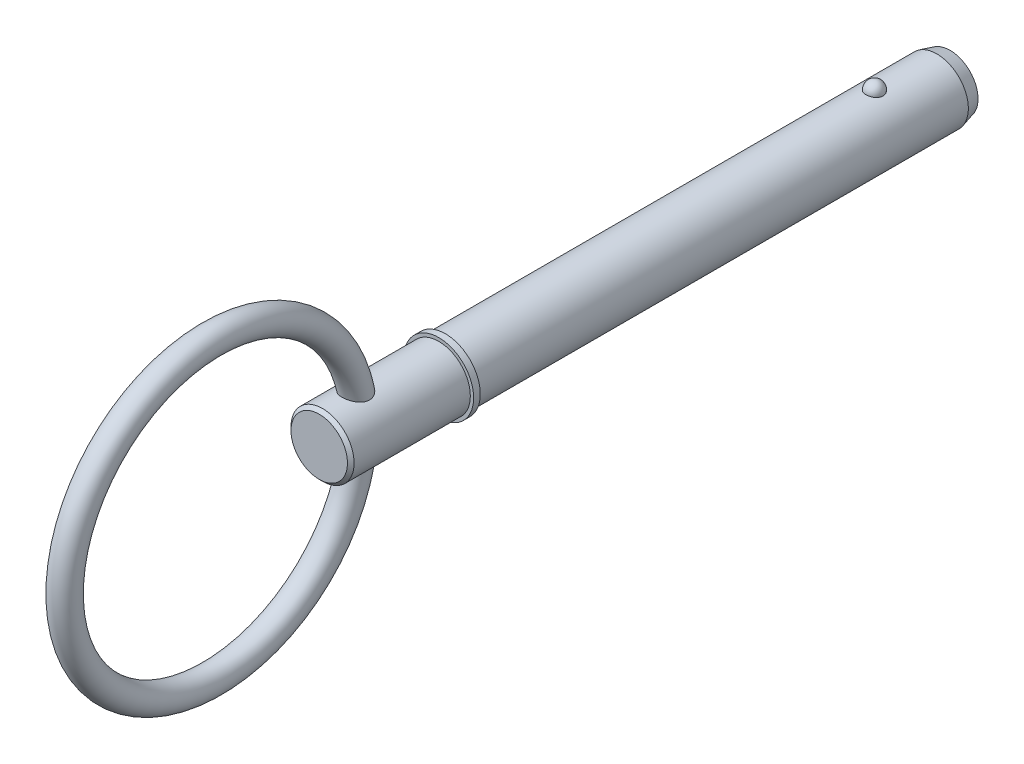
ISO-10303-21;
HEADER;
FILE_DESCRIPTION(('STEP AP214'),'2;1');
FILE_NAME('part.step','',(''),(''),'','','');
FILE_SCHEMA(('AUTOMOTIVE_DESIGN { 1 0 10303 214 1 1 1 1 }'));
ENDSEC;
DATA;
#1=APPLICATION_CONTEXT('core data for automotive mechanical design processes');
#2=APPLICATION_PROTOCOL_DEFINITION('international standard','automotive_design',2000,#1);
#3=PRODUCT_CONTEXT('',#1,'mechanical');
#4=PRODUCT('Part','Part','',(#3));
#5=PRODUCT_RELATED_PRODUCT_CATEGORY('part','',(#4));
#6=PRODUCT_DEFINITION_FORMATION('','',#4);
#7=PRODUCT_DEFINITION_CONTEXT('part definition',#1,'design');
#8=PRODUCT_DEFINITION('design','',#6,#7);
#9=PRODUCT_DEFINITION_SHAPE('','',#8);
#10=(LENGTH_UNIT() NAMED_UNIT(*) SI_UNIT(.MILLI.,.METRE.));
#11=(NAMED_UNIT(*) PLANE_ANGLE_UNIT() SI_UNIT($,.RADIAN.));
#12=(NAMED_UNIT(*) SI_UNIT($,.STERADIAN.) SOLID_ANGLE_UNIT());
#13=UNCERTAINTY_MEASURE_WITH_UNIT(LENGTH_MEASURE(1.E-05),#10,'distance_accuracy_value','');
#14=(GEOMETRIC_REPRESENTATION_CONTEXT(3) GLOBAL_UNCERTAINTY_ASSIGNED_CONTEXT((#13)) GLOBAL_UNIT_ASSIGNED_CONTEXT((#10,
#11,#12)) REPRESENTATION_CONTEXT('',''));
#15=CARTESIAN_POINT('',(0.,0.,0.));
#16=DIRECTION('',(0.,0.,1.));
#17=DIRECTION('',(1.,0.,0.));
#18=AXIS2_PLACEMENT_3D('',#15,#16,#17);
#19=CARTESIAN_POINT('',(0.,0.,63.5));
#20=DIRECTION('',(0.,0.,-1.));
#21=DIRECTION('',(-1.,0.,0.));
#22=AXIS2_PLACEMENT_3D('',#19,#20,#21);
#23=CYLINDRICAL_SURFACE('',#22,4.765);
#24=CARTESIAN_POINT('',(1.27812710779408,4.59038300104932,-1.29));
#25=CARTESIAN_POINT('',(1.27812572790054,4.59038414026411,-1.2178688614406));
#26=CARTESIAN_POINT('',(1.27223018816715,4.59203736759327,-1.14572000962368));
#27=CARTESIAN_POINT('',(1.24878929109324,4.59846646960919,-1.00346315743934));
#28=CARTESIAN_POINT('',(1.23123896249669,4.60324367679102,-0.933356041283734));
#29=CARTESIAN_POINT('',(1.18493861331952,4.61537801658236,-0.797215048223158));
#30=CARTESIAN_POINT('',(1.15619354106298,4.62273400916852,-0.731179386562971));
#31=CARTESIAN_POINT('',(1.08822596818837,4.6392032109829,-0.604986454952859));
#32=CARTESIAN_POINT('',(1.04900384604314,4.64831635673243,-0.544828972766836));
#33=CARTESIAN_POINT('',(0.960865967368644,4.66733302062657,-0.431775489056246));
#34=CARTESIAN_POINT('',(0.911906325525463,4.67723999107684,-0.37891426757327));
#35=CARTESIAN_POINT('',(0.805678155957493,4.69670280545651,-0.282245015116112));
#36=CARTESIAN_POINT('',(0.748409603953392,4.70625864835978,-0.238437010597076));
#37=CARTESIAN_POINT('',(0.627266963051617,4.72392767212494,-0.161207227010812));
#38=CARTESIAN_POINT('',(0.563411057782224,4.73204466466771,-0.127757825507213));
#39=CARTESIAN_POINT('',(0.430755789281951,4.74595788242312,-0.0720471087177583));
#40=CARTESIAN_POINT('',(0.361956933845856,4.75175434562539,-0.0497846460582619));
#41=CARTESIAN_POINT('',(0.222605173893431,4.76030056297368,-0.0173750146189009));
#42=CARTESIAN_POINT('',(0.152101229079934,4.76309991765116,-0.00703038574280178));
#43=CARTESIAN_POINT('',(0.0103009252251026,4.76551622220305,0.00191361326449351));
#44=CARTESIAN_POINT('',(-0.0609953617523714,4.76513345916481,0.000514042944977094));
#45=CARTESIAN_POINT('',(-0.201348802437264,4.76125496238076,-0.0138891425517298));
#46=CARTESIAN_POINT('',(-0.270423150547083,4.75780093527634,-0.0267372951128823));
#47=CARTESIAN_POINT('',(-0.405377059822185,4.74820737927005,-0.0634598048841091));
#48=CARTESIAN_POINT('',(-0.471256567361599,4.74206780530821,-0.0873343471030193));
#49=CARTESIAN_POINT('',(-0.598375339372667,4.72771507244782,-0.14561183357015));
#50=CARTESIAN_POINT('',(-0.659587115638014,4.71949070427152,-0.180071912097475));
#51=CARTESIAN_POINT('',(-0.775356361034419,4.70185936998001,-0.258542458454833));
#52=CARTESIAN_POINT('',(-0.8299131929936,4.69245229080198,-0.302553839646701));
#53=CARTESIAN_POINT('',(-0.931895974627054,4.67327936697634,-0.39982907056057));
#54=CARTESIAN_POINT('',(-0.979176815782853,4.66351011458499,-0.453244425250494));
#55=CARTESIAN_POINT('',(-1.06421220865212,4.64484426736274,-0.567321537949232));
#56=CARTESIAN_POINT('',(-1.10196613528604,4.63594772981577,-0.6279837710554));
#57=CARTESIAN_POINT('',(-1.16735225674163,4.61992036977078,-0.75558557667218));
#58=CARTESIAN_POINT('',(-1.19487251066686,4.61280933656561,-0.822585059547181));
#59=CARTESIAN_POINT('',(-1.23851975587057,4.60128324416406,-0.96041771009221));
#60=CARTESIAN_POINT('',(-1.25464705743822,4.59686811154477,-1.03125077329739));
#61=CARTESIAN_POINT('',(-1.27505790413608,4.59124882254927,-1.17443804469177));
#62=CARTESIAN_POINT('',(-1.27938868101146,4.59003186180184,-1.24678501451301));
#63=CARTESIAN_POINT('',(-1.27623192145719,4.5909105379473,-1.3911989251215));
#64=CARTESIAN_POINT('',(-1.26874468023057,4.59300609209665,-1.46326587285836));
#65=CARTESIAN_POINT('',(-1.24220427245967,4.60025423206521,-1.60473192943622));
#66=CARTESIAN_POINT('',(-1.2232043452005,4.60539274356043,-1.67414176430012));
#67=CARTESIAN_POINT('',(-1.17415910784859,4.61813957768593,-1.80870154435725));
#68=CARTESIAN_POINT('',(-1.1441133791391,4.62574799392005,-1.87385132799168));
#69=CARTESIAN_POINT('',(-1.07354327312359,4.64263368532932,-1.99841604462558));
#70=CARTESIAN_POINT('',(-1.03296580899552,4.65191934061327,-2.05779976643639));
#71=CARTESIAN_POINT('',(-0.942433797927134,4.67110036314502,-2.16881966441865));
#72=CARTESIAN_POINT('',(-0.892478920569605,4.68099575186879,-2.22045556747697));
#73=CARTESIAN_POINT('',(-0.784302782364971,4.70033161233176,-2.31471696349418));
#74=CARTESIAN_POINT('',(-0.726054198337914,4.70977043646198,-2.35731146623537));
#75=CARTESIAN_POINT('',(-0.602997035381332,4.72709995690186,-2.43206620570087));
#76=CARTESIAN_POINT('',(-0.538188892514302,4.73499075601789,-2.46422713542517));
#77=CARTESIAN_POINT('',(-0.404639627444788,4.7482563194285,-2.51687454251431));
#78=CARTESIAN_POINT('',(-0.335953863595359,4.7536596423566,-2.53749415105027));
#79=CARTESIAN_POINT('',(-0.195948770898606,4.76148510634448,-2.56703727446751));
#80=CARTESIAN_POINT('',(-0.124629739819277,4.76390758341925,-2.57596210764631));
#81=CARTESIAN_POINT('',(0.0172696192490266,4.76548774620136,-2.58180339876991));
#82=CARTESIAN_POINT('',(0.0878407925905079,4.76470225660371,-2.57892886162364));
#83=CARTESIAN_POINT('',(0.227467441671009,4.76008019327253,-2.56172603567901));
#84=CARTESIAN_POINT('',(0.296522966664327,4.75624371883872,-2.54739811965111));
#85=CARTESIAN_POINT('',(0.430942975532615,4.74595041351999,-2.50776251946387));
#86=CARTESIAN_POINT('',(0.496319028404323,4.7395023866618,-2.4824917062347));
#87=CARTESIAN_POINT('',(0.621860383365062,4.72467083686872,-2.4216730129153));
#88=CARTESIAN_POINT('',(0.682025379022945,4.71628720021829,-2.38612452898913));
#89=CARTESIAN_POINT('',(0.796409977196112,4.69833598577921,-2.30511163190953));
#90=CARTESIAN_POINT('',(0.850529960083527,4.68875291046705,-2.25951003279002));
#91=CARTESIAN_POINT('',(0.950412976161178,4.66953243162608,-2.15992428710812));
#92=CARTESIAN_POINT('',(0.996174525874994,4.65989501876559,-2.10593865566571));
#93=CARTESIAN_POINT('',(1.07885962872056,4.64145616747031,-1.99009376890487));
#94=CARTESIAN_POINT('',(1.11562789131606,4.63267081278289,-1.92812106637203));
#95=CARTESIAN_POINT('',(1.17840570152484,4.61710269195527,-1.79873681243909));
#96=CARTESIAN_POINT('',(1.20441973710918,4.61031909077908,-1.73132754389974));
#97=CARTESIAN_POINT('',(1.24242116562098,4.60021170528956,-1.60192906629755));
#98=CARTESIAN_POINT('',(1.25578772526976,4.59655387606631,-1.54036674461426));
#99=CARTESIAN_POINT('',(1.27364121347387,4.59163904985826,-1.41587409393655));
#100=CARTESIAN_POINT('',(1.2781283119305,4.59038200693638,-1.35294379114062));
#101=CARTESIAN_POINT('',(1.27812710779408,4.59038300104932,-1.29));
#102=B_SPLINE_CURVE_WITH_KNOTS('',3,(#24,#25,#26,#27,#28,#29,#30,#31,#32,#33,#34,#35,#36,#37,
#38,#39,#40,#41,#42,#43,#44,#45,#46,#47,#48,#49,#50,#51,#52,#53,#54,#55,#56,#57,#58,#59,#60,#61,
#62,#63,#64,#65,#66,#67,#68,#69,#70,#71,#72,#73,#74,#75,#76,#77,#78,#79,#80,#81,#82,#83,#84,#85,
#86,#87,#88,#89,#90,#91,#92,#93,#94,#95,#96,#97,#98,#99,#100,#101),.UNSPECIFIED.,.T.,.F.,(4,2,2,
2,2,2,2,2,2,2,2,2,2,2,2,2,2,2,2,2,2,2,2,2,2,2,2,2,2,2,2,2,2,2,2,2,2,2,4),(0.,0.216167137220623,
0.432426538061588,0.648590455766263,0.864746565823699,1.0818998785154,1.29905382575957,
1.51562361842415,1.73217119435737,1.94507683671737,2.15796327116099,2.36800220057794,
2.57804465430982,2.78924132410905,3.00045819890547,3.21545551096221,3.43046692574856,
3.64776550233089,3.8650581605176,4.08147951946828,4.29789547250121,4.51331818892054,
4.72874907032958,4.94528769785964,5.16183395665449,5.37911087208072,5.59637335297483,
5.8110751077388,6.02575265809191,6.23664413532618,6.44752874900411,6.65770827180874,
6.86790014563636,7.08116060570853,7.29445887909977,7.51121476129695,7.72788009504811,
7.91651762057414,8.10515153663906),.UNSPECIFIED.);
#103=CARTESIAN_POINT('',(1.27812710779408,4.59038300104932,-1.29));
#104=VERTEX_POINT('',#103);
#105=EDGE_CURVE('E101',#104,#104,#102,.T.);
#106=ORIENTED_EDGE('',*,*,#105,.T.);
#107=EDGE_LOOP('',(#106));
#108=FACE_BOUND('',#107,.T.);
#109=CARTESIAN_POINT('',(0.,0.,-10.7));
#110=DIRECTION('',(0.,0.,-1.));
#111=DIRECTION('',(-1.,0.,0.));
#112=AXIS2_PLACEMENT_3D('',#109,#110,#111);
#113=CIRCLE('',#112,4.765);
#114=CARTESIAN_POINT('',(-4.765,0.,-10.7));
#115=VERTEX_POINT('',#114);
#116=EDGE_CURVE('E109',#115,#115,#113,.F.);
#117=ORIENTED_EDGE('',*,*,#116,.T.);
#118=EDGE_LOOP('',(#117));
#119=FACE_BOUND('',#118,.T.);
#120=CARTESIAN_POINT('',(0.,0.,63.5));
#121=DIRECTION('',(0.,0.,1.));
#122=DIRECTION('',(1.,0.,0.));
#123=AXIS2_PLACEMENT_3D('',#120,#121,#122);
#124=CIRCLE('',#123,4.765);
#125=CARTESIAN_POINT('',(4.765,0.,63.5));
#126=VERTEX_POINT('',#125);
#127=EDGE_CURVE('E107',#126,#126,#124,.T.);
#128=ORIENTED_EDGE('',*,*,#127,.F.);
#129=EDGE_LOOP('',(#128));
#130=FACE_BOUND('',#129,.T.);
#131=ADVANCED_FACE('F39',(#108,#119,#130),#23,.T.);
#132=CARTESIAN_POINT('',(0.,0.,-12.7));
#133=DIRECTION('',(0.,0.,-1.));
#134=DIRECTION('',(-1.,0.,0.));
#135=AXIS2_PLACEMENT_3D('',#132,#133,#134);
#136=PLANE('',#135);
#137=CARTESIAN_POINT('',(0.,0.,-12.7));
#138=DIRECTION('',(0.,0.,-1.));
#139=DIRECTION('',(-1.,0.,0.));
#140=AXIS2_PLACEMENT_3D('',#137,#138,#139);
#141=CIRCLE('',#140,4.22910161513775);
#142=CARTESIAN_POINT('',(-4.22910161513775,0.,-12.7));
#143=VERTEX_POINT('',#142);
#144=EDGE_CURVE('E141',#143,#143,#141,.T.);
#145=ORIENTED_EDGE('',*,*,#144,.T.);
#146=EDGE_LOOP('',(#145));
#147=FACE_BOUND('',#146,.T.);
#148=ADVANCED_FACE('F87',(#147),#136,.T.);
#149=CARTESIAN_POINT('',(0.,0.,-12.7));
#150=DIRECTION('',(0.,0.,1.));
#151=DIRECTION('',(1.,0.,0.));
#152=AXIS2_PLACEMENT_3D('',#149,#150,#151);
#153=CONICAL_SURFACE('',#152,4.22910161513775,0.261799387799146);
#154=ORIENTED_EDGE('',*,*,#116,.F.);
#155=EDGE_LOOP('',(#154));
#156=FACE_BOUND('',#155,.T.);
#157=ORIENTED_EDGE('',*,*,#144,.F.);
#158=EDGE_LOOP('',(#157));
#159=FACE_BOUND('',#158,.T.);
#160=ADVANCED_FACE('F93',(#156,#159),#153,.T.);
#161=CARTESIAN_POINT('',(0.,4.765,-1.29));
#162=DIRECTION('',(0.,1.,0.));
#163=DIRECTION('',(0.,0.,-1.));
#164=AXIS2_PLACEMENT_3D('',#161,#162,#163);
#165=SPHERICAL_SURFACE('',#164,1.29);
#166=ORIENTED_EDGE('',*,*,#105,.F.);
#167=EDGE_LOOP('',(#166));
#168=FACE_BOUND('',#167,.T.);
#169=ADVANCED_FACE('F112',(#168),#165,.T.);
#170=CARTESIAN_POINT('',(0.,0.,63.5));
#171=DIRECTION('',(0.,0.,-1.));
#172=DIRECTION('',(-1.,0.,0.));
#173=AXIS2_PLACEMENT_3D('',#170,#171,#172);
#174=PLANE('',#173);
#175=ORIENTED_EDGE('',*,*,#127,.T.);
#176=EDGE_LOOP('',(#175));
#177=FACE_BOUND('',#176,.T.);
#178=CARTESIAN_POINT('',(0.,0.,63.5));
#179=DIRECTION('',(0.,0.,-1.));
#180=DIRECTION('',(-1.,0.,0.));
#181=AXIS2_PLACEMENT_3D('',#178,#179,#180);
#182=CIRCLE('',#181,5.265);
#183=CARTESIAN_POINT('',(-5.265,0.,63.5));
#184=VERTEX_POINT('',#183);
#185=EDGE_CURVE('E108',#184,#184,#182,.T.);
#186=ORIENTED_EDGE('',*,*,#185,.T.);
#187=EDGE_LOOP('',(#186));
#188=FACE_BOUND('',#187,.T.);
#189=ADVANCED_FACE('F116',(#177,#188),#174,.T.);
#190=CARTESIAN_POINT('',(0.,0.,33.7287874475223));
#191=DIRECTION('',(0.,0.,-1.));
#192=DIRECTION('',(-1.,0.,0.));
#193=AXIS2_PLACEMENT_3D('',#190,#191,#192);
#194=CYLINDRICAL_SURFACE('',#193,5.265);
#195=CARTESIAN_POINT('',(0.,0.,64.5));
#196=DIRECTION('',(0.,0.,-1.));
#197=DIRECTION('',(-1.,0.,0.));
#198=AXIS2_PLACEMENT_3D('',#195,#196,#197);
#199=CIRCLE('',#198,5.265);
#200=CARTESIAN_POINT('',(-5.265,0.,64.5));
#201=VERTEX_POINT('',#200);
#202=EDGE_CURVE('E133',#201,#201,#199,.T.);
#203=ORIENTED_EDGE('',*,*,#202,.T.);
#204=EDGE_LOOP('',(#203));
#205=FACE_BOUND('',#204,.T.);
#206=ORIENTED_EDGE('',*,*,#185,.F.);
#207=EDGE_LOOP('',(#206));
#208=FACE_BOUND('',#207,.T.);
#209=ADVANCED_FACE('F120',(#205,#208),#194,.T.);
#210=CARTESIAN_POINT('',(0.,5.265,64.5));
#211=DIRECTION('',(0.,0.,1.));
#212=DIRECTION('',(1.,0.,0.));
#213=AXIS2_PLACEMENT_3D('',#210,#211,#212);
#214=PLANE('',#213);
#215=CARTESIAN_POINT('',(0.,0.,64.5));
#216=DIRECTION('',(0.,0.,1.));
#217=DIRECTION('',(1.,0.,0.));
#218=AXIS2_PLACEMENT_3D('',#215,#216,#217);
#219=CIRCLE('',#218,4.765);
#220=CARTESIAN_POINT('',(4.765,0.,64.5));
#221=VERTEX_POINT('',#220);
#222=EDGE_CURVE('E111',#221,#221,#219,.T.);
#223=ORIENTED_EDGE('',*,*,#222,.F.);
#224=EDGE_LOOP('',(#223));
#225=FACE_BOUND('',#224,.T.);
#226=ORIENTED_EDGE('',*,*,#202,.F.);
#227=EDGE_LOOP('',(#226));
#228=FACE_BOUND('',#227,.T.);
#229=ADVANCED_FACE('F84',(#225,#228),#214,.T.);
#230=CARTESIAN_POINT('',(0.,0.,82.55));
#231=DIRECTION('',(0.,0.,-1.));
#232=DIRECTION('',(-1.,0.,0.));
#233=AXIS2_PLACEMENT_3D('',#230,#231,#232);
#234=CYLINDRICAL_SURFACE('',#233,4.765);
#235=CARTESIAN_POINT('',(-1.17603588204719,-4.61759294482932,75.3837200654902));
#236=CARTESIAN_POINT('',(-1.08605054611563,-4.6405075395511,75.3215688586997));
#237=CARTESIAN_POINT('',(-0.990486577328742,-4.66202408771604,75.2667393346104));
#238=CARTESIAN_POINT('',(-0.790762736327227,-4.70002969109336,75.1729957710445));
#239=CARTESIAN_POINT('',(-0.686587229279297,-4.7165093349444,75.1341114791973));
#240=CARTESIAN_POINT('',(-0.472539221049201,-4.7427361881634,75.073267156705));
#241=CARTESIAN_POINT('',(-0.362665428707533,-4.75248186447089,75.0513109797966));
#242=CARTESIAN_POINT('',(-0.140482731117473,-4.7642267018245,75.0249366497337));
#243=CARTESIAN_POINT('',(-0.0281752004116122,-4.7662301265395,75.0205088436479));
#244=CARTESIAN_POINT('',(0.193745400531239,-4.76233166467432,75.0292082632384));
#245=CARTESIAN_POINT('',(0.303372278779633,-4.75656024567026,75.0420457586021));
#246=CARTESIAN_POINT('',(0.518724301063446,-4.73791484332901,75.0844340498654));
#247=CARTESIAN_POINT('',(0.624448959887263,-4.72503997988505,75.1139869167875));
#248=CARTESIAN_POINT('',(0.829434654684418,-4.69340588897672,75.1892085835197));
#249=CARTESIAN_POINT('',(0.928674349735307,-4.6746283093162,75.2349277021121));
#250=CARTESIAN_POINT('',(1.11777413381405,-4.63305392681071,75.3414733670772));
#251=CARTESIAN_POINT('',(1.20763216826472,-4.61025624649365,75.4023032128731));
#252=CARTESIAN_POINT('',(1.37762760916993,-4.56238439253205,75.5394393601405));
#253=CARTESIAN_POINT('',(1.45749020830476,-4.53726959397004,75.6160728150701));
#254=CARTESIAN_POINT('',(1.60275140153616,-4.48801828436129,75.7822939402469));
#255=CARTESIAN_POINT('',(1.66815155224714,-4.46388166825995,75.871880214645));
#256=CARTESIAN_POINT('',(1.78162069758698,-4.41980966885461,76.0604689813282));
#257=CARTESIAN_POINT('',(1.82993675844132,-4.3998162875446,76.1593086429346));
#258=CARTESIAN_POINT('',(1.90902953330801,-4.36608532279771,76.3647395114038));
#259=CARTESIAN_POINT('',(1.93981696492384,-4.35234391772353,76.4713259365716));
#260=CARTESIAN_POINT('',(1.9818112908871,-4.33337618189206,76.682380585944));
#261=CARTESIAN_POINT('',(1.99406945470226,-4.32769391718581,76.78660066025));
#262=CARTESIAN_POINT('',(2.0025484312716,-4.32377679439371,76.9958125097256));
#263=CARTESIAN_POINT('',(1.99876733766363,-4.32554282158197,77.1008043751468));
#264=CARTESIAN_POINT('',(1.97595504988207,-4.33600911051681,77.3091056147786));
#265=CARTESIAN_POINT('',(1.95686739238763,-4.3447350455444,77.4124073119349));
#266=CARTESIAN_POINT('',(1.90457346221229,-4.36790947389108,77.6146792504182));
#267=CARTESIAN_POINT('',(1.87136191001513,-4.38236010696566,77.7136478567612));
#268=CARTESIAN_POINT('',(1.78747856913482,-4.41728816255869,77.9164706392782));
#269=CARTESIAN_POINT('',(1.73524632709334,-4.43826528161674,78.0195927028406));
#270=CARTESIAN_POINT('',(1.61607256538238,-4.48303292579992,78.2163865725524));
#271=CARTESIAN_POINT('',(1.5491157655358,-4.50682636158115,78.3100484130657));
#272=CARTESIAN_POINT('',(1.39359064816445,-4.55746895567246,78.4953838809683));
#273=CARTESIAN_POINT('',(1.30346928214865,-4.58437060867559,78.5857503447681));
#274=CARTESIAN_POINT('',(1.10794390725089,-4.6354985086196,78.7490111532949));
#275=CARTESIAN_POINT('',(1.00255934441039,-4.65972809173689,78.8219274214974));
#276=CARTESIAN_POINT('',(0.803761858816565,-4.69755503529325,78.9324077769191));
#277=CARTESIAN_POINT('',(0.712935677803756,-4.71231838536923,78.9742306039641));
#278=CARTESIAN_POINT('',(0.525172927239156,-4.73691370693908,79.0429362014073));
#279=CARTESIAN_POINT('',(0.428242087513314,-4.7467502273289,79.0698327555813));
#280=CARTESIAN_POINT('',(0.230351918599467,-4.76046566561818,79.1071470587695));
#281=CARTESIAN_POINT('',(0.129376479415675,-4.76431768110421,79.1174904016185));
#282=CARTESIAN_POINT('',(-0.0728965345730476,-4.76551495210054,79.1207168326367));
#283=CARTESIAN_POINT('',(-0.174194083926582,-4.76286070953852,79.1136012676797));
#284=CARTESIAN_POINT('',(-0.366467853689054,-4.751792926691,79.0835798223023));
#285=CARTESIAN_POINT('',(-0.45765922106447,-4.74381187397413,79.0618588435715));
#286=CARTESIAN_POINT('',(-0.635226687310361,-4.72331548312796,79.0050844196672));
#287=CARTESIAN_POINT('',(-0.721601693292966,-4.71079912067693,78.9700279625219));
#288=CARTESIAN_POINT('',(-0.893212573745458,-4.68139468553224,78.8855597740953));
#289=CARTESIAN_POINT('',(-0.978027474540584,-4.66427939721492,78.8353775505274));
#290=CARTESIAN_POINT('',(-1.13917803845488,-4.62756330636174,78.7236420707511));
#291=CARTESIAN_POINT('',(-1.21550961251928,-4.6079613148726,78.6620833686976));
#292=CARTESIAN_POINT('',(-1.37033540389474,-4.56452178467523,78.5186885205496));
#293=CARTESIAN_POINT('',(-1.44723650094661,-4.5405070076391,78.4351843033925));
#294=CARTESIAN_POINT('',(-1.58763850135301,-4.49334232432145,78.2572920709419));
#295=CARTESIAN_POINT('',(-1.65112672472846,-4.47019325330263,78.1628938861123));
#296=CARTESIAN_POINT('',(-1.77033243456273,-4.42444393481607,77.9532060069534));
#297=CARTESIAN_POINT('',(-1.82420433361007,-4.40224259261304,77.836768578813));
#298=CARTESIAN_POINT('',(-1.91169086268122,-4.36496831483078,77.5954090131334));
#299=CARTESIAN_POINT('',(-1.94531523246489,-4.34989195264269,77.4704909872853));
#300=CARTESIAN_POINT('',(-1.98892523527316,-4.33012255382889,77.2220163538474));
#301=CARTESIAN_POINT('',(-1.99998275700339,-4.32495941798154,77.0986899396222));
#302=CARTESIAN_POINT('',(-2.00001713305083,-4.32494814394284,76.8520738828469));
#303=CARTESIAN_POINT('',(-1.98902141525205,-4.33008719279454,76.7287843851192));
#304=CARTESIAN_POINT('',(-1.94752572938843,-4.34888267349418,76.5032137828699));
#305=CARTESIAN_POINT('',(-1.9197975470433,-4.36132278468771,76.4003106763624));
#306=CARTESIAN_POINT('',(-1.84805595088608,-4.39220107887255,76.2012512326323));
#307=CARTESIAN_POINT('',(-1.80403476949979,-4.4106421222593,76.1050981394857));
#308=CARTESIAN_POINT('',(-1.70232000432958,-4.45086896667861,75.9244579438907));
#309=CARTESIAN_POINT('',(-1.64499853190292,-4.47255887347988,75.8397380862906));
#310=CARTESIAN_POINT('',(-1.51770958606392,-4.51733419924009,75.6810122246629));
#311=CARTESIAN_POINT('',(-1.44776268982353,-4.54041730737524,75.6069891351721));
#312=CARTESIAN_POINT('',(-1.34143544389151,-4.57239833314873,75.51104340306));
#313=CARTESIAN_POINT('',(-1.30955259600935,-4.58164274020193,75.4841153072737));
#314=CARTESIAN_POINT('',(-1.24406394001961,-4.59985727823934,75.4323409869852));
#315=CARTESIAN_POINT('',(-1.21045807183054,-4.6088273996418,75.4074948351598));
#316=CARTESIAN_POINT('',(-1.17603588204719,-4.61759294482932,75.3837200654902));
#317=B_SPLINE_CURVE_WITH_KNOTS('',3,(#235,#236,#237,#238,#239,#240,#241,#242,#243,#244,#245,
#246,#247,#248,#249,#250,#251,#252,#253,#254,#255,#256,#257,#258,#259,#260,#261,#262,#263,#264,
#265,#266,#267,#268,#269,#270,#271,#272,#273,#274,#275,#276,#277,#278,#279,#280,#281,#282,#283,
#284,#285,#286,#287,#288,#289,#290,#291,#292,#293,#294,#295,#296,#297,#298,#299,#300,#301,#302,
#303,#304,#305,#306,#307,#308,#309,#310,#311,#312,#313,#314,#315,#316),.UNSPECIFIED.,.T.,.F.,(4,
2,2,2,2,2,2,2,2,2,2,2,2,2,2,2,2,2,2,2,2,2,2,2,2,2,2,2,2,2,2,2,2,2,2,2,2,2,2,2,4),(0.,
0.335054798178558,0.67073186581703,1.00648532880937,1.34205386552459,1.67206089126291,
2.00210881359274,2.33319321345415,2.66434996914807,3.00321157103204,3.34203668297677,
3.67573940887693,4.00923787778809,4.32299322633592,4.63678586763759,4.95174139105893,
5.26681474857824,5.61785759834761,5.96926647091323,6.35862694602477,6.74749565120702,
7.04947204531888,7.35116911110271,7.6542185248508,7.9572445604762,8.23825252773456,
8.51932400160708,8.81825171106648,9.11732288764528,9.46404422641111,9.811091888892,
10.1997682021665,10.5882573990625,10.9578189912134,11.3269212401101,11.6472091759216,
11.9676500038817,12.2800235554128,12.5918925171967,12.7200569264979,12.8482258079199),.UNSPECIFIED.);
#318=CARTESIAN_POINT('',(-1.17603588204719,-4.61759294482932,75.3837200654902));
#319=VERTEX_POINT('',#318);
#320=EDGE_CURVE('E10',#319,#319,#317,.T.);
#321=ORIENTED_EDGE('',*,*,#320,.F.);
#322=EDGE_LOOP('',(#321));
#323=FACE_BOUND('',#322,.T.);
#324=CARTESIAN_POINT('',(-1.17603588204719,4.61759294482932,75.3837200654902));
#325=CARTESIAN_POINT('',(-1.26499234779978,4.59493450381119,75.4451699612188));
#326=CARTESIAN_POINT('',(-1.34870034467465,4.57085993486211,75.5139152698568));
#327=CARTESIAN_POINT('',(-1.50334626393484,4.52236448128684,75.664635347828));
#328=CARTESIAN_POINT('',(-1.57425996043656,4.49794303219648,75.7466346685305));
#329=CARTESIAN_POINT('',(-1.7013018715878,4.45144771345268,75.9222345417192));
#330=CARTESIAN_POINT('',(-1.75740699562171,4.42937754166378,76.0158528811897));
#331=CARTESIAN_POINT('',(-1.85287755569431,4.3903018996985,76.2121668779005));
#332=CARTESIAN_POINT('',(-1.89225871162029,4.37329167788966,76.3148539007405));
#333=CARTESIAN_POINT('',(-1.95188661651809,4.34699775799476,76.5218576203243));
#334=CARTESIAN_POINT('',(-1.97286468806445,4.33742068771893,76.6259265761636));
#335=CARTESIAN_POINT('',(-1.99814509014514,4.32583397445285,76.8364714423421));
#336=CARTESIAN_POINT('',(-2.00244696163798,4.32382453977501,76.9429474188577));
#337=CARTESIAN_POINT('',(-1.99499900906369,4.32726361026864,77.1527706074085));
#338=CARTESIAN_POINT('',(-1.9836061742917,4.33254625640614,77.256134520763));
#339=CARTESIAN_POINT('',(-1.94643618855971,4.34936983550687,77.4596911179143));
#340=CARTESIAN_POINT('',(-1.92065444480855,4.3609127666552,77.5598827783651));
#341=CARTESIAN_POINT('',(-1.85292379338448,4.3901452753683,77.7641042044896));
#342=CARTESIAN_POINT('',(-1.80971134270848,4.40830066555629,77.8676462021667));
#343=CARTESIAN_POINT('',(-1.70892742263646,4.44833985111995,78.0667684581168));
#344=CARTESIAN_POINT('',(-1.65134284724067,4.47022704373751,78.1623413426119));
#345=CARTESIAN_POINT('',(-1.51475300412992,4.51847764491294,78.3552600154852));
#346=CARTESIAN_POINT('',(-1.43395667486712,4.54505660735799,78.4512914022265));
#347=CARTESIAN_POINT('',(-1.25684082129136,4.59718102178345,78.6281328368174));
#348=CARTESIAN_POINT('',(-1.16053129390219,4.62272712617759,78.7089526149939));
#349=CARTESIAN_POINT('',(-0.972192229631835,4.66558476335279,78.8393265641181));
#350=CARTESIAN_POINT('',(-0.882391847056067,4.68355428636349,78.8918799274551));
#351=CARTESIAN_POINT('',(-0.69483616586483,4.71502283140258,78.9820221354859));
#352=CARTESIAN_POINT('',(-0.597087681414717,4.72852563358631,79.0196236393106));
#353=CARTESIAN_POINT('',(-0.395321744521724,4.74966109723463,79.0778751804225));
#354=CARTESIAN_POINT('',(-0.29126929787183,4.7572569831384,79.0984190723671));
#355=CARTESIAN_POINT('',(-0.0808979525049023,4.76547327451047,79.1206246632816));
#356=CARTESIAN_POINT('',(0.0254198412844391,4.76609700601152,79.1222953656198));
#357=CARTESIAN_POINT('',(0.225327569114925,4.7606097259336,79.1074850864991));
#358=CARTESIAN_POINT('',(0.319084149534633,4.75519734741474,79.0928871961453));
#359=CARTESIAN_POINT('',(0.502750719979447,4.73930039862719,79.0493972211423));
#360=CARTESIAN_POINT('',(0.592660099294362,4.7288150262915,79.020502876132));
#361=CARTESIAN_POINT('',(0.768777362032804,4.70343779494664,78.9490413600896));
#362=CARTESIAN_POINT('',(0.854839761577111,4.68844387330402,78.9061552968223));
#363=CARTESIAN_POINT('',(1.01943666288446,4.65543047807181,78.8087469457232));
#364=CARTESIAN_POINT('',(1.09796821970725,4.63740982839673,78.7542201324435));
#365=CARTESIAN_POINT('',(1.25751825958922,4.59691257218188,78.6264656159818));
#366=CARTESIAN_POINT('',(1.33721103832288,4.57417011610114,78.5516678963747));
#367=CARTESIAN_POINT('',(1.48461190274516,4.52847869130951,78.3910829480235));
#368=CARTESIAN_POINT('',(1.55230949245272,4.50552956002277,78.3052862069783));
#369=CARTESIAN_POINT('',(1.68366050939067,4.45825797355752,78.1114045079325));
#370=CARTESIAN_POINT('',(1.74532014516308,4.43421533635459,78.0018899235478));
#371=CARTESIAN_POINT('',(1.85007805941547,4.39154308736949,77.7732696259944));
#372=CARTESIAN_POINT('',(1.89317429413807,4.37291407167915,77.6541628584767));
#373=CARTESIAN_POINT('',(1.958572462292,4.34402041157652,77.4097631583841));
#374=CARTESIAN_POINT('',(1.98095022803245,4.33372528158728,77.284494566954));
#375=CARTESIAN_POINT('',(2.00301292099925,4.32358016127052,77.0315942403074));
#376=CARTESIAN_POINT('',(2.00273000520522,4.32371536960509,76.9039661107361));
#377=CARTESIAN_POINT('',(1.97997568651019,4.3341693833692,76.6682474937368));
#378=CARTESIAN_POINT('',(1.96044562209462,4.34313814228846,76.5598066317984));
#379=CARTESIAN_POINT('',(1.903681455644,4.3683153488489,76.3485431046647));
#380=CARTESIAN_POINT('',(1.86644884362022,4.38452318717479,76.2457199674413));
#381=CARTESIAN_POINT('',(1.77811542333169,4.42104679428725,76.0547100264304));
#382=CARTESIAN_POINT('',(1.72797707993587,4.44105894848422,75.9660156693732));
#383=CARTESIAN_POINT('',(1.61439500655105,4.48359504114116,75.7982868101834));
#384=CARTESIAN_POINT('',(1.55094927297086,4.50611935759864,75.7192537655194));
#385=CARTESIAN_POINT('',(1.40889349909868,4.55259151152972,75.5687053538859));
#386=CARTESIAN_POINT('',(1.32968750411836,4.57655455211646,75.4977571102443));
#387=CARTESIAN_POINT('',(1.16035884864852,4.62238936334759,75.3695060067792));
#388=CARTESIAN_POINT('',(1.07023361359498,4.64426063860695,75.3122063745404));
#389=CARTESIAN_POINT('',(0.877362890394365,4.68460759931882,75.2103166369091));
#390=CARTESIAN_POINT('',(0.774249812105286,4.70290564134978,75.1663495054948));
#391=CARTESIAN_POINT('',(0.561430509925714,4.73302876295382,75.0954843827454));
#392=CARTESIAN_POINT('',(0.451725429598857,4.74485496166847,75.0685834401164));
#393=CARTESIAN_POINT('',(0.230282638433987,4.76071009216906,75.0327633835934));
#394=CARTESIAN_POINT('',(0.11858761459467,4.76483485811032,75.0236232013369));
#395=CARTESIAN_POINT('',(-0.104911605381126,4.76515532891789,75.0229082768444));
#396=CARTESIAN_POINT('',(-0.216715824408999,4.76134861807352,75.0313388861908));
#397=CARTESIAN_POINT('',(-0.435231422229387,4.74632552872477,75.0652456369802));
#398=CARTESIAN_POINT('',(-0.541996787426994,4.73523460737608,75.0904332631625));
#399=CARTESIAN_POINT('',(-0.749371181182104,4.70686626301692,75.1569215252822));
#400=CARTESIAN_POINT('',(-0.849990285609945,4.68959930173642,75.1981949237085));
#401=CARTESIAN_POINT('',(-0.986108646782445,4.6620261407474,75.2672359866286));
#402=CARTESIAN_POINT('',(-1.0252576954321,4.65355983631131,75.2887724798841));
#403=CARTESIAN_POINT('',(-1.10191286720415,4.63600664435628,75.3343673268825));
#404=CARTESIAN_POINT('',(-1.13941901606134,4.62691976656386,75.358425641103));
#405=CARTESIAN_POINT('',(-1.17603588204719,4.61759294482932,75.3837200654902));
#406=B_SPLINE_CURVE_WITH_KNOTS('',3,(#324,#325,#326,#327,#328,#329,#330,#331,#332,#333,#334,
#335,#336,#337,#338,#339,#340,#341,#342,#343,#344,#345,#346,#347,#348,#349,#350,#351,#352,#353,
#354,#355,#356,#357,#358,#359,#360,#361,#362,#363,#364,#365,#366,#367,#368,#369,#370,#371,#372,
#373,#374,#375,#376,#377,#378,#379,#380,#381,#382,#383,#384,#385,#386,#387,#388,#389,#390,#391,
#392,#393,#394,#395,#396,#397,#398,#399,#400,#401,#402,#403,#404,#405),.UNSPECIFIED.,.T.,.F.,(4,
2,2,2,2,2,2,2,2,2,2,2,2,2,2,2,2,2,2,2,2,2,2,2,2,2,2,2,2,2,2,2,2,2,2,2,2,2,2,2,4),(0.,
0.331234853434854,0.663090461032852,0.995460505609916,1.3275174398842,1.64568783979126,
1.96386699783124,2.27492717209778,2.58608669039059,2.92571998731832,3.26566413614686,
3.64875195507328,4.0315938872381,4.34706664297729,4.66227172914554,4.97942386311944,
5.29642469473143,5.58021908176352,5.86405835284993,6.15488068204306,6.44581627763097,
6.77943874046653,7.11335170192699,7.49545660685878,7.87760356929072,8.25834622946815,
8.63854860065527,8.96843568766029,9.29829501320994,9.60842872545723,9.91860916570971,
10.2441707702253,10.5698092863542,10.9089029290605,11.2479379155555,11.5827251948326,
11.9176144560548,12.2468820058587,12.5755944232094,12.7119417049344,12.8482868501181),.UNSPECIFIED.);
#407=CARTESIAN_POINT('',(-1.17603588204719,4.61759294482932,75.3837200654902));
#408=VERTEX_POINT('',#407);
#409=EDGE_CURVE('E51',#408,#408,#406,.T.);
#410=ORIENTED_EDGE('',*,*,#409,.F.);
#411=EDGE_LOOP('',(#410));
#412=FACE_BOUND('',#411,.T.);
#413=CARTESIAN_POINT('',(0.,0.,82.05));
#414=DIRECTION('',(0.,0.,-1.));
#415=DIRECTION('',(-1.,0.,0.));
#416=AXIS2_PLACEMENT_3D('',#413,#414,#415);
#417=CIRCLE('',#416,4.765);
#418=CARTESIAN_POINT('',(-4.765,0.,82.05));
#419=VERTEX_POINT('',#418);
#420=EDGE_CURVE('E63',#419,#419,#417,.T.);
#421=ORIENTED_EDGE('',*,*,#420,.T.);
#422=EDGE_LOOP('',(#421));
#423=FACE_BOUND('',#422,.T.);
#424=ORIENTED_EDGE('',*,*,#222,.T.);
#425=EDGE_LOOP('',(#424));
#426=FACE_BOUND('',#425,.T.);
#427=ADVANCED_FACE('F68',(#323,#412,#423,#426),#234,.T.);
#428=CARTESIAN_POINT('',(0.,0.,82.55));
#429=DIRECTION('',(0.,0.,-1.));
#430=DIRECTION('',(-1.,0.,0.));
#431=AXIS2_PLACEMENT_3D('',#428,#429,#430);
#432=PLANE('',#431);
#433=CARTESIAN_POINT('',(0.,0.,82.55));
#434=DIRECTION('',(0.,0.,-1.));
#435=DIRECTION('',(-1.,0.,0.));
#436=AXIS2_PLACEMENT_3D('',#433,#434,#435);
#437=CIRCLE('',#436,4.26499999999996);
#438=CARTESIAN_POINT('',(-4.26499999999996,0.,82.55));
#439=VERTEX_POINT('',#438);
#440=EDGE_CURVE('E57',#439,#439,#437,.F.);
#441=ORIENTED_EDGE('',*,*,#440,.T.);
#442=EDGE_LOOP('',(#441));
#443=FACE_BOUND('',#442,.T.);
#444=ADVANCED_FACE('F75',(#443),#432,.F.);
#445=CARTESIAN_POINT('',(0.,0.,82.05));
#446=DIRECTION('',(0.,0.,-1.));
#447=DIRECTION('',(-1.,0.,0.));
#448=AXIS2_PLACEMENT_3D('',#445,#446,#447);
#449=CONICAL_SURFACE('',#448,4.765,0.785398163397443);
#450=ORIENTED_EDGE('',*,*,#440,.F.);
#451=EDGE_LOOP('',(#450));
#452=FACE_BOUND('',#451,.T.);
#453=ORIENTED_EDGE('',*,*,#420,.F.);
#454=EDGE_LOOP('',(#453));
#455=FACE_BOUND('',#454,.T.);
#456=ADVANCED_FACE('F41',(#452,#455),#449,.T.);
#457=CARTESIAN_POINT('',(0.,0.,98.775));
#458=DIRECTION('',(1.,0.,0.));
#459=DIRECTION('',(0.,0.,-1.));
#460=AXIS2_PLACEMENT_3D('',#457,#458,#459);
#461=TOROIDAL_SURFACE('',#460,22.225,2.);
#462=ORIENTED_EDGE('',*,*,#320,.T.);
#463=EDGE_LOOP('',(#462));
#464=FACE_BOUND('',#463,.T.);
#465=ORIENTED_EDGE('',*,*,#409,.T.);
#466=EDGE_LOOP('',(#465));
#467=FACE_BOUND('',#466,.T.);
#468=ADVANCED_FACE('F72',(#464,#467),#461,.T.);
#469=CLOSED_SHELL('',(#131,#148,#160,#169,#189,#209,#229,#427,#444,#456,#468));
#470=MANIFOLD_SOLID_BREP('B2',#469);
#471=ADVANCED_BREP_SHAPE_REPRESENTATION('',(#18,#470),#14);
#472=SHAPE_DEFINITION_REPRESENTATION(#9,#471);
ENDSEC;
END-ISO-10303-21;
